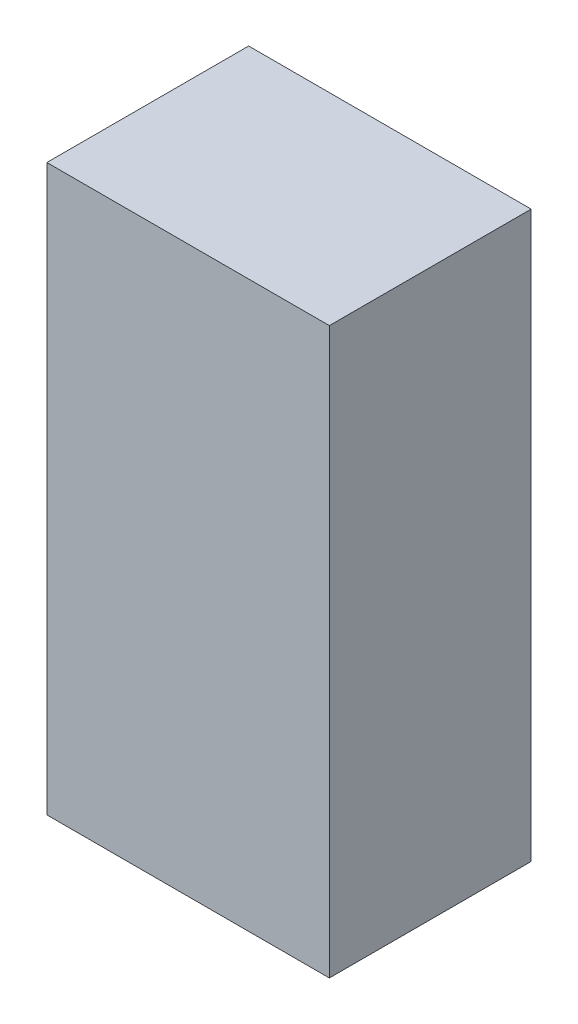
ISO-10303-21;
HEADER;
FILE_DESCRIPTION(('STEP AP214'),'2;1');
FILE_NAME('part.step','',(''),(''),'','','');
FILE_SCHEMA(('AUTOMOTIVE_DESIGN { 1 0 10303 214 1 1 1 1 }'));
ENDSEC;
DATA;
#1=APPLICATION_CONTEXT('core data for automotive mechanical design processes');
#2=APPLICATION_PROTOCOL_DEFINITION('international standard','automotive_design',2000,#1);
#3=PRODUCT_CONTEXT('',#1,'mechanical');
#4=PRODUCT('Part','Part','',(#3));
#5=PRODUCT_RELATED_PRODUCT_CATEGORY('part','',(#4));
#6=PRODUCT_DEFINITION_FORMATION('','',#4);
#7=PRODUCT_DEFINITION_CONTEXT('part definition',#1,'design');
#8=PRODUCT_DEFINITION('design','',#6,#7);
#9=PRODUCT_DEFINITION_SHAPE('','',#8);
#10=(LENGTH_UNIT() NAMED_UNIT(*) SI_UNIT(.MILLI.,.METRE.));
#11=(NAMED_UNIT(*) PLANE_ANGLE_UNIT() SI_UNIT($,.RADIAN.));
#12=(NAMED_UNIT(*) SI_UNIT($,.STERADIAN.) SOLID_ANGLE_UNIT());
#13=UNCERTAINTY_MEASURE_WITH_UNIT(LENGTH_MEASURE(1.E-05),#10,'distance_accuracy_value','');
#14=(GEOMETRIC_REPRESENTATION_CONTEXT(3) GLOBAL_UNCERTAINTY_ASSIGNED_CONTEXT((#13)) GLOBAL_UNIT_ASSIGNED_CONTEXT((#10,
#11,#12)) REPRESENTATION_CONTEXT('',''));
#15=CARTESIAN_POINT('',(0.,0.,0.));
#16=DIRECTION('',(0.,0.,1.));
#17=DIRECTION('',(1.,0.,0.));
#18=AXIS2_PLACEMENT_3D('',#15,#16,#17);
#19=CARTESIAN_POINT('',(-8.89000000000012,17.7800000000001,12.7));
#20=DIRECTION('',(1.,0.,0.));
#21=DIRECTION('',(0.,1.,0.));
#22=AXIS2_PLACEMENT_3D('',#19,#20,#21);
#23=PLANE('',#22);
#24=DIRECTION('',(0.,-1.,0.));
#25=VECTOR('',#24,1.);
#26=CARTESIAN_POINT('',(-8.89000000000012,17.7800000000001,0.));
#27=LINE('',#26,#25);
#28=CARTESIAN_POINT('',(-8.89000000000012,17.7800000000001,0.));
#29=VERTEX_POINT('',#28);
#30=CARTESIAN_POINT('',(-8.89000000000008,-17.7799999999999,0.));
#31=VERTEX_POINT('',#30);
#32=EDGE_CURVE('E96',#29,#31,#27,.T.);
#33=ORIENTED_EDGE('',*,*,#32,.T.);
#34=DIRECTION('',(0.,0.,-1.));
#35=VECTOR('',#34,1.);
#36=CARTESIAN_POINT('',(-8.89000000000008,-17.7799999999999,12.7));
#37=LINE('',#36,#35);
#38=CARTESIAN_POINT('',(-8.89000000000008,-17.7799999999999,12.7));
#39=VERTEX_POINT('',#38);
#40=EDGE_CURVE('E11',#39,#31,#37,.T.);
#41=ORIENTED_EDGE('',*,*,#40,.F.);
#42=DIRECTION('',(0.,-1.,0.));
#43=VECTOR('',#42,1.);
#44=CARTESIAN_POINT('',(-8.89000000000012,17.7800000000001,12.7));
#45=LINE('',#44,#43);
#46=CARTESIAN_POINT('',(-8.89000000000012,17.7800000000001,12.7));
#47=VERTEX_POINT('',#46);
#48=EDGE_CURVE('E84',#47,#39,#45,.T.);
#49=ORIENTED_EDGE('',*,*,#48,.F.);
#50=DIRECTION('',(0.,0.,-1.));
#51=VECTOR('',#50,1.);
#52=CARTESIAN_POINT('',(-8.89000000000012,17.7800000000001,12.7));
#53=LINE('',#52,#51);
#54=EDGE_CURVE('E92',#47,#29,#53,.T.);
#55=ORIENTED_EDGE('',*,*,#54,.T.);
#56=EDGE_LOOP('',(#33,#41,#49,#55));
#57=FACE_BOUND('',#56,.T.);
#58=ADVANCED_FACE('F33',(#57),#23,.F.);
#59=CARTESIAN_POINT('',(-8.89000000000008,-17.7799999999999,12.7));
#60=DIRECTION('',(0.,1.,0.));
#61=DIRECTION('',(0.,0.,1.));
#62=AXIS2_PLACEMENT_3D('',#59,#60,#61);
#63=PLANE('',#62);
#64=DIRECTION('',(1.,0.,0.));
#65=VECTOR('',#64,1.);
#66=CARTESIAN_POINT('',(-8.89000000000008,-17.7799999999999,0.));
#67=LINE('',#66,#65);
#68=CARTESIAN_POINT('',(8.89000000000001,-17.7799999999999,0.));
#69=VERTEX_POINT('',#68);
#70=EDGE_CURVE('E88',#31,#69,#67,.T.);
#71=ORIENTED_EDGE('',*,*,#70,.T.);
#72=DIRECTION('',(0.,0.,-1.));
#73=VECTOR('',#72,1.);
#74=CARTESIAN_POINT('',(8.89000000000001,-17.7799999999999,12.7));
#75=LINE('',#74,#73);
#76=CARTESIAN_POINT('',(8.89000000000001,-17.7799999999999,12.7));
#77=VERTEX_POINT('',#76);
#78=EDGE_CURVE('E41',#77,#69,#75,.T.);
#79=ORIENTED_EDGE('',*,*,#78,.F.);
#80=DIRECTION('',(1.,0.,0.));
#81=VECTOR('',#80,1.);
#82=CARTESIAN_POINT('',(-8.89000000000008,-17.7799999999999,12.7));
#83=LINE('',#82,#81);
#84=EDGE_CURVE('E79',#39,#77,#83,.T.);
#85=ORIENTED_EDGE('',*,*,#84,.F.);
#86=ORIENTED_EDGE('',*,*,#40,.T.);
#87=EDGE_LOOP('',(#71,#79,#85,#86));
#88=FACE_BOUND('',#87,.T.);
#89=ADVANCED_FACE('F87',(#88),#63,.F.);
#90=CARTESIAN_POINT('',(8.8899999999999,17.7800000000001,12.7));
#91=DIRECTION('',(-1.,0.,0.));
#92=DIRECTION('',(0.,-1.,0.));
#93=AXIS2_PLACEMENT_3D('',#90,#91,#92);
#94=PLANE('',#93);
#95=DIRECTION('',(0.,1.,0.));
#96=VECTOR('',#95,1.);
#97=CARTESIAN_POINT('',(8.8899999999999,17.7800000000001,0.));
#98=LINE('',#97,#96);
#99=CARTESIAN_POINT('',(8.8899999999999,17.7800000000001,0.));
#100=VERTEX_POINT('',#99);
#101=EDGE_CURVE('E66',#69,#100,#98,.T.);
#102=ORIENTED_EDGE('',*,*,#101,.T.);
#103=DIRECTION('',(0.,0.,-1.));
#104=VECTOR('',#103,1.);
#105=CARTESIAN_POINT('',(8.8899999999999,17.7800000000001,12.7));
#106=LINE('',#105,#104);
#107=CARTESIAN_POINT('',(8.8899999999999,17.7800000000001,12.7));
#108=VERTEX_POINT('',#107);
#109=EDGE_CURVE('E89',#108,#100,#106,.T.);
#110=ORIENTED_EDGE('',*,*,#109,.F.);
#111=DIRECTION('',(0.,1.,0.));
#112=VECTOR('',#111,1.);
#113=CARTESIAN_POINT('',(8.8899999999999,17.7800000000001,12.7));
#114=LINE('',#113,#112);
#115=EDGE_CURVE('E82',#77,#108,#114,.T.);
#116=ORIENTED_EDGE('',*,*,#115,.F.);
#117=ORIENTED_EDGE('',*,*,#78,.T.);
#118=EDGE_LOOP('',(#102,#110,#116,#117));
#119=FACE_BOUND('',#118,.T.);
#120=ADVANCED_FACE('F90',(#119),#94,.F.);
#121=CARTESIAN_POINT('',(-8.89000000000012,17.7800000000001,12.7));
#122=DIRECTION('',(0.,-1.,0.));
#123=DIRECTION('',(0.,0.,-1.));
#124=AXIS2_PLACEMENT_3D('',#121,#122,#123);
#125=PLANE('',#124);
#126=DIRECTION('',(-1.,0.,0.));
#127=VECTOR('',#126,1.);
#128=CARTESIAN_POINT('',(-8.89000000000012,17.7800000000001,0.));
#129=LINE('',#128,#127);
#130=EDGE_CURVE('E72',#100,#29,#129,.T.);
#131=ORIENTED_EDGE('',*,*,#130,.T.);
#132=ORIENTED_EDGE('',*,*,#54,.F.);
#133=DIRECTION('',(-1.,0.,0.));
#134=VECTOR('',#133,1.);
#135=CARTESIAN_POINT('',(-8.89000000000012,17.7800000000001,12.7));
#136=LINE('',#135,#134);
#137=EDGE_CURVE('E49',#108,#47,#136,.T.);
#138=ORIENTED_EDGE('',*,*,#137,.F.);
#139=ORIENTED_EDGE('',*,*,#109,.T.);
#140=EDGE_LOOP('',(#131,#132,#138,#139));
#141=FACE_BOUND('',#140,.T.);
#142=ADVANCED_FACE('F103',(#141),#125,.F.);
#143=CARTESIAN_POINT('',(0.,0.,12.7));
#144=DIRECTION('',(0.,0.,1.));
#145=DIRECTION('',(1.,0.,0.));
#146=AXIS2_PLACEMENT_3D('',#143,#144,#145);
#147=PLANE('',#146);
#148=ORIENTED_EDGE('',*,*,#48,.T.);
#149=ORIENTED_EDGE('',*,*,#84,.T.);
#150=ORIENTED_EDGE('',*,*,#115,.T.);
#151=ORIENTED_EDGE('',*,*,#137,.T.);
#152=EDGE_LOOP('',(#148,#149,#150,#151));
#153=FACE_BOUND('',#152,.T.);
#154=ADVANCED_FACE('F80',(#153),#147,.T.);
#155=CARTESIAN_POINT('',(0.,0.,0.));
#156=DIRECTION('',(0.,0.,1.));
#157=DIRECTION('',(1.,0.,0.));
#158=AXIS2_PLACEMENT_3D('',#155,#156,#157);
#159=PLANE('',#158);
#160=ORIENTED_EDGE('',*,*,#32,.F.);
#161=ORIENTED_EDGE('',*,*,#130,.F.);
#162=ORIENTED_EDGE('',*,*,#101,.F.);
#163=ORIENTED_EDGE('',*,*,#70,.F.);
#164=EDGE_LOOP('',(#160,#161,#162,#163));
#165=FACE_BOUND('',#164,.T.);
#166=ADVANCED_FACE('F106',(#165),#159,.F.);
#167=CLOSED_SHELL('',(#58,#89,#120,#142,#154,#166));
#168=MANIFOLD_SOLID_BREP('B2',#167);
#169=ADVANCED_BREP_SHAPE_REPRESENTATION('',(#18,#168),#14);
#170=SHAPE_DEFINITION_REPRESENTATION(#9,#169);
ENDSEC;
END-ISO-10303-21;
